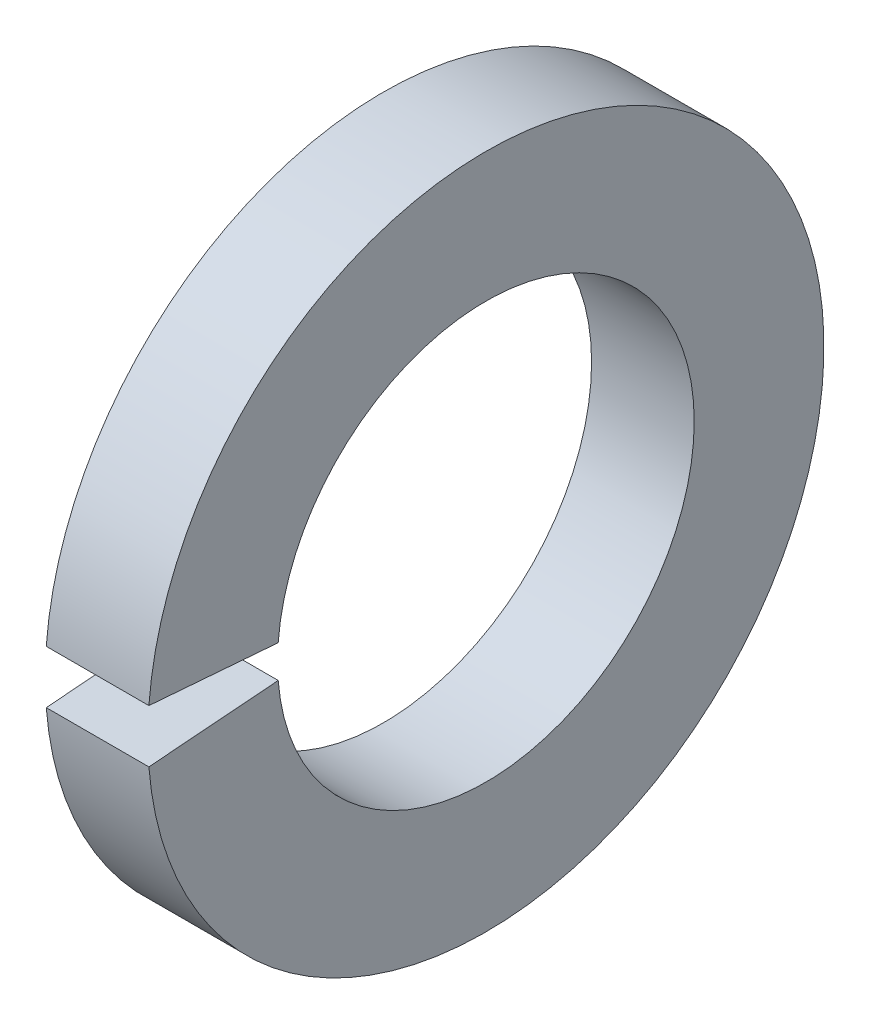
from build123d import *

# Parameters (mm, degrees)
SKETCH1_W = 6.35
SKETCH1_H = 8.0264
GAP_DEPTH = 31.254849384


with BuildPart() as part:
    # Sketch1 → Base-Revolve (revolve)
    with BuildSketch(Plane.XY, mode=Mode.PRIVATE) as base_revolve_sk:
        with Locations((-3.175, 16.9037)):
            Rectangle(SKETCH1_W, SKETCH1_H)
    revolve(base_revolve_sk.sketch.rotate(Axis((-34.925, 0, 0), (1, 0, 0)), 90), axis=Axis((-34.925, 0, 0), (1, 0, 0)))

    # Sketch2 → Gap (cut, through all)
    with BuildSketch(Plane(origin=(0, 0, 0), x_dir=(0, -1, 0), z_dir=(-1, 0, 0))):
        with BuildLine():
            Line((0, 0), (1.673943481, 21.269468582))
            ThreePointArc((1.673943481, 21.269468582), (0, 21.335238), (-1.673943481, 21.269468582))
            Line((-1.673943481, 21.269468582), (0, 0))
        make_face()
    extrude(amount=GAP_DEPTH, mode=Mode.SUBTRACT)


solid = part.part
